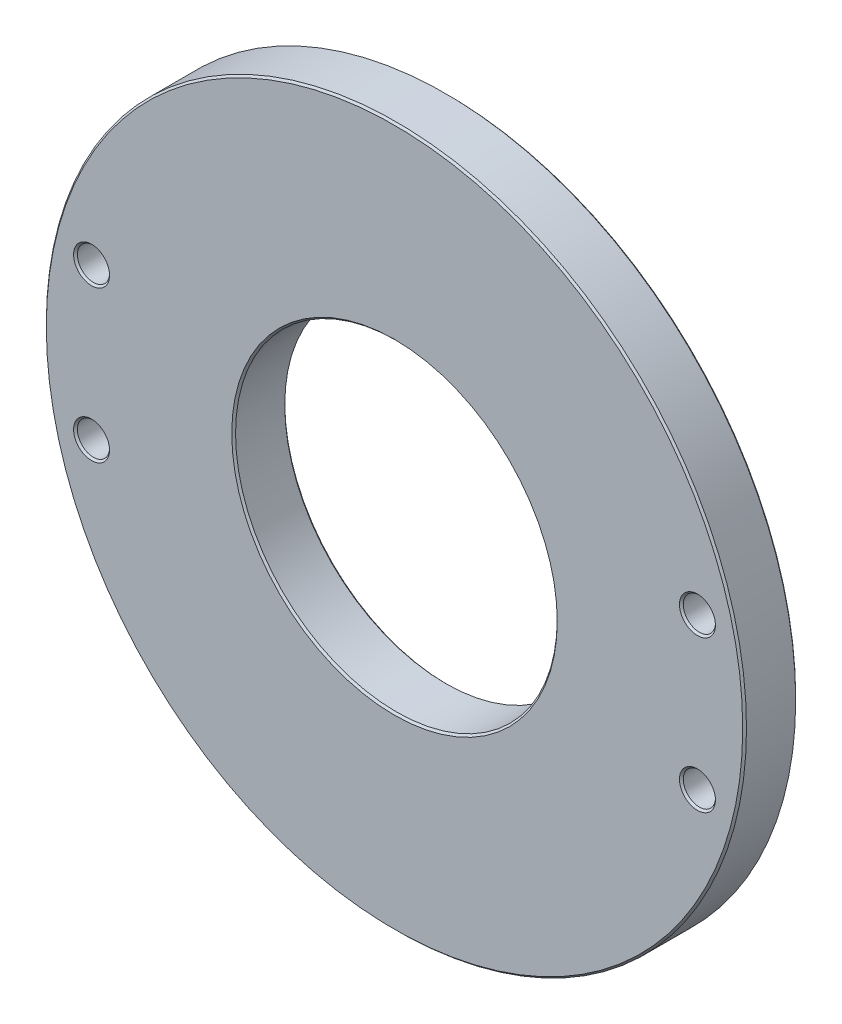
ISO-10303-21;
HEADER;
FILE_DESCRIPTION(('STEP AP214'),'2;1');
FILE_NAME('part.step','',(''),(''),'','','');
FILE_SCHEMA(('AUTOMOTIVE_DESIGN { 1 0 10303 214 1 1 1 1 }'));
ENDSEC;
DATA;
#1=APPLICATION_CONTEXT('core data for automotive mechanical design processes');
#2=APPLICATION_PROTOCOL_DEFINITION('international standard','automotive_design',2000,#1);
#3=PRODUCT_CONTEXT('',#1,'mechanical');
#4=PRODUCT('Part','Part','',(#3));
#5=PRODUCT_RELATED_PRODUCT_CATEGORY('part','',(#4));
#6=PRODUCT_DEFINITION_FORMATION('','',#4);
#7=PRODUCT_DEFINITION_CONTEXT('part definition',#1,'design');
#8=PRODUCT_DEFINITION('design','',#6,#7);
#9=PRODUCT_DEFINITION_SHAPE('','',#8);
#10=(LENGTH_UNIT() NAMED_UNIT(*) SI_UNIT(.MILLI.,.METRE.));
#11=(NAMED_UNIT(*) PLANE_ANGLE_UNIT() SI_UNIT($,.RADIAN.));
#12=(NAMED_UNIT(*) SI_UNIT($,.STERADIAN.) SOLID_ANGLE_UNIT());
#13=UNCERTAINTY_MEASURE_WITH_UNIT(LENGTH_MEASURE(1.E-05),#10,'distance_accuracy_value','');
#14=(GEOMETRIC_REPRESENTATION_CONTEXT(3) GLOBAL_UNCERTAINTY_ASSIGNED_CONTEXT((#13)) GLOBAL_UNIT_ASSIGNED_CONTEXT((#10,
#11,#12)) REPRESENTATION_CONTEXT('',''));
#15=CARTESIAN_POINT('',(0.,0.,0.));
#16=DIRECTION('',(0.,0.,1.));
#17=DIRECTION('',(1.,0.,0.));
#18=AXIS2_PLACEMENT_3D('',#15,#16,#17);
#19=CARTESIAN_POINT('',(0.,0.,-14.));
#20=DIRECTION('',(0.,0.,1.));
#21=DIRECTION('',(1.,0.,0.));
#22=AXIS2_PLACEMENT_3D('',#19,#20,#21);
#23=CYLINDRICAL_SURFACE('',#22,92.5);
#24=CARTESIAN_POINT('',(0.,0.,-13.5));
#25=DIRECTION('',(0.,0.,1.));
#26=DIRECTION('',(1.,0.,0.));
#27=AXIS2_PLACEMENT_3D('',#24,#25,#26);
#28=CIRCLE('',#27,92.5);
#29=CARTESIAN_POINT('',(92.5,0.,-13.5));
#30=VERTEX_POINT('',#29);
#31=EDGE_CURVE('E427',#30,#30,#28,.T.);
#32=ORIENTED_EDGE('',*,*,#31,.T.);
#33=EDGE_LOOP('',(#32));
#34=FACE_BOUND('',#33,.T.);
#35=CARTESIAN_POINT('',(0.,0.,-0.500000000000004));
#36=DIRECTION('',(0.,0.,1.));
#37=DIRECTION('',(1.,0.,0.));
#38=AXIS2_PLACEMENT_3D('',#35,#36,#37);
#39=CIRCLE('',#38,92.5);
#40=CARTESIAN_POINT('',(92.5,0.,-0.500000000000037));
#41=VERTEX_POINT('',#40);
#42=EDGE_CURVE('E430',#41,#41,#39,.F.);
#43=ORIENTED_EDGE('',*,*,#42,.T.);
#44=EDGE_LOOP('',(#43));
#45=FACE_BOUND('',#44,.T.);
#46=ADVANCED_FACE('F354',(#34,#45),#23,.T.);
#47=CARTESIAN_POINT('',(0.,0.,-14.));
#48=DIRECTION('',(0.,0.,1.));
#49=DIRECTION('',(1.,0.,0.));
#50=AXIS2_PLACEMENT_3D('',#47,#48,#49);
#51=PLANE('',#50);
#52=CARTESIAN_POINT('',(-80.0390529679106,20.,-14.));
#53=DIRECTION('',(0.,0.,1.));
#54=DIRECTION('',(1.,0.,0.));
#55=AXIS2_PLACEMENT_3D('',#52,#53,#54);
#56=CIRCLE('',#55,4.75000000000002);
#57=CARTESIAN_POINT('',(-75.2890529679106,20.,-14.));
#58=VERTEX_POINT('',#57);
#59=EDGE_CURVE('E373',#58,#58,#56,.T.);
#60=ORIENTED_EDGE('',*,*,#59,.T.);
#61=EDGE_LOOP('',(#60));
#62=FACE_BOUND('',#61,.T.);
#63=CARTESIAN_POINT('',(-80.0390529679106,-20.,-14.));
#64=DIRECTION('',(0.,0.,1.));
#65=DIRECTION('',(1.,0.,0.));
#66=AXIS2_PLACEMENT_3D('',#63,#64,#65);
#67=CIRCLE('',#66,4.75000000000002);
#68=CARTESIAN_POINT('',(-75.2890529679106,-20.,-14.));
#69=VERTEX_POINT('',#68);
#70=EDGE_CURVE('E376',#69,#69,#67,.T.);
#71=ORIENTED_EDGE('',*,*,#70,.T.);
#72=EDGE_LOOP('',(#71));
#73=FACE_BOUND('',#72,.T.);
#74=CARTESIAN_POINT('',(80.0390529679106,-20.,-14.));
#75=DIRECTION('',(0.,0.,1.));
#76=DIRECTION('',(1.,0.,0.));
#77=AXIS2_PLACEMENT_3D('',#74,#75,#76);
#78=CIRCLE('',#77,4.75000000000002);
#79=CARTESIAN_POINT('',(84.7890529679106,-20.,-14.));
#80=VERTEX_POINT('',#79);
#81=EDGE_CURVE('E379',#80,#80,#78,.T.);
#82=ORIENTED_EDGE('',*,*,#81,.T.);
#83=EDGE_LOOP('',(#82));
#84=FACE_BOUND('',#83,.T.);
#85=CARTESIAN_POINT('',(80.0390529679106,20.,-14.));
#86=DIRECTION('',(0.,0.,1.));
#87=DIRECTION('',(1.,0.,0.));
#88=AXIS2_PLACEMENT_3D('',#85,#86,#87);
#89=CIRCLE('',#88,4.75000000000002);
#90=CARTESIAN_POINT('',(84.7890529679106,20.,-14.));
#91=VERTEX_POINT('',#90);
#92=EDGE_CURVE('E382',#91,#91,#89,.T.);
#93=ORIENTED_EDGE('',*,*,#92,.T.);
#94=EDGE_LOOP('',(#93));
#95=FACE_BOUND('',#94,.T.);
#96=CARTESIAN_POINT('',(0.,0.,-14.));
#97=DIRECTION('',(0.,0.,1.));
#98=DIRECTION('',(1.,0.,0.));
#99=AXIS2_PLACEMENT_3D('',#96,#97,#98);
#100=CIRCLE('',#99,92.);
#101=CARTESIAN_POINT('',(92.,0.,-14.));
#102=VERTEX_POINT('',#101);
#103=EDGE_CURVE('E421',#102,#102,#100,.F.);
#104=ORIENTED_EDGE('',*,*,#103,.T.);
#105=EDGE_LOOP('',(#104));
#106=FACE_BOUND('',#105,.T.);
#107=CARTESIAN_POINT('',(0.,0.,-14.));
#108=DIRECTION('',(0.,0.,1.));
#109=DIRECTION('',(1.,0.,0.));
#110=AXIS2_PLACEMENT_3D('',#107,#108,#109);
#111=CIRCLE('',#110,43.);
#112=CARTESIAN_POINT('',(43.,0.,-14.));
#113=VERTEX_POINT('',#112);
#114=EDGE_CURVE('E424',#113,#113,#111,.T.);
#115=ORIENTED_EDGE('',*,*,#114,.T.);
#116=EDGE_LOOP('',(#115));
#117=FACE_BOUND('',#116,.T.);
#118=ADVANCED_FACE('F447',(#62,#73,#84,#95,#106,#117),#51,.F.);
#119=CARTESIAN_POINT('',(0.,0.,0.));
#120=DIRECTION('',(0.,0.,1.));
#121=DIRECTION('',(1.,0.,0.));
#122=AXIS2_PLACEMENT_3D('',#119,#120,#121);
#123=PLANE('',#122);
#124=CARTESIAN_POINT('',(-80.0390529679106,20.,0.));
#125=DIRECTION('',(0.,0.,1.));
#126=DIRECTION('',(1.,0.,0.));
#127=AXIS2_PLACEMENT_3D('',#124,#125,#126);
#128=CIRCLE('',#127,4.75);
#129=CARTESIAN_POINT('',(-75.2890529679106,20.,0.));
#130=VERTEX_POINT('',#129);
#131=EDGE_CURVE('E394',#130,#130,#128,.F.);
#132=ORIENTED_EDGE('',*,*,#131,.T.);
#133=EDGE_LOOP('',(#132));
#134=FACE_BOUND('',#133,.T.);
#135=CARTESIAN_POINT('',(-80.0390529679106,-20.,0.));
#136=DIRECTION('',(0.,0.,1.));
#137=DIRECTION('',(1.,0.,0.));
#138=AXIS2_PLACEMENT_3D('',#135,#136,#137);
#139=CIRCLE('',#138,4.75);
#140=CARTESIAN_POINT('',(-75.2890529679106,-20.,0.));
#141=VERTEX_POINT('',#140);
#142=EDGE_CURVE('E397',#141,#141,#139,.F.);
#143=ORIENTED_EDGE('',*,*,#142,.T.);
#144=EDGE_LOOP('',(#143));
#145=FACE_BOUND('',#144,.T.);
#146=CARTESIAN_POINT('',(80.0390529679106,20.,0.));
#147=DIRECTION('',(0.,0.,1.));
#148=DIRECTION('',(1.,0.,0.));
#149=AXIS2_PLACEMENT_3D('',#146,#147,#148);
#150=CIRCLE('',#149,4.75);
#151=CARTESIAN_POINT('',(84.7890529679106,20.,0.));
#152=VERTEX_POINT('',#151);
#153=EDGE_CURVE('E400',#152,#152,#150,.F.);
#154=ORIENTED_EDGE('',*,*,#153,.T.);
#155=EDGE_LOOP('',(#154));
#156=FACE_BOUND('',#155,.T.);
#157=CARTESIAN_POINT('',(80.0390529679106,-20.,0.));
#158=DIRECTION('',(0.,0.,1.));
#159=DIRECTION('',(1.,0.,0.));
#160=AXIS2_PLACEMENT_3D('',#157,#158,#159);
#161=CIRCLE('',#160,4.75);
#162=CARTESIAN_POINT('',(84.7890529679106,-20.,0.));
#163=VERTEX_POINT('',#162);
#164=EDGE_CURVE('E403',#163,#163,#161,.F.);
#165=ORIENTED_EDGE('',*,*,#164,.T.);
#166=EDGE_LOOP('',(#165));
#167=FACE_BOUND('',#166,.T.);
#168=CARTESIAN_POINT('',(0.,0.,0.));
#169=DIRECTION('',(0.,0.,1.));
#170=DIRECTION('',(1.,0.,0.));
#171=AXIS2_PLACEMENT_3D('',#168,#169,#170);
#172=CIRCLE('',#171,92.);
#173=CARTESIAN_POINT('',(92.,0.,0.));
#174=VERTEX_POINT('',#173);
#175=EDGE_CURVE('E415',#174,#174,#172,.T.);
#176=ORIENTED_EDGE('',*,*,#175,.T.);
#177=EDGE_LOOP('',(#176));
#178=FACE_BOUND('',#177,.T.);
#179=CARTESIAN_POINT('',(0.,0.,0.));
#180=DIRECTION('',(0.,0.,1.));
#181=DIRECTION('',(1.,0.,0.));
#182=AXIS2_PLACEMENT_3D('',#179,#180,#181);
#183=CIRCLE('',#182,43.);
#184=CARTESIAN_POINT('',(43.,0.,0.));
#185=VERTEX_POINT('',#184);
#186=EDGE_CURVE('E418',#185,#185,#183,.F.);
#187=ORIENTED_EDGE('',*,*,#186,.T.);
#188=EDGE_LOOP('',(#187));
#189=FACE_BOUND('',#188,.T.);
#190=ADVANCED_FACE('F443',(#134,#145,#156,#167,#178,#189),#123,.T.);
#191=CARTESIAN_POINT('',(0.,0.,-14.));
#192=DIRECTION('',(0.,0.,1.));
#193=DIRECTION('',(1.,0.,0.));
#194=AXIS2_PLACEMENT_3D('',#191,#192,#193);
#195=CYLINDRICAL_SURFACE('',#194,42.5);
#196=CARTESIAN_POINT('',(0.,0.,-13.5));
#197=DIRECTION('',(0.,0.,1.));
#198=DIRECTION('',(1.,0.,0.));
#199=AXIS2_PLACEMENT_3D('',#196,#197,#198);
#200=CIRCLE('',#199,42.5);
#201=CARTESIAN_POINT('',(42.5,0.,-13.5));
#202=VERTEX_POINT('',#201);
#203=EDGE_CURVE('E409',#202,#202,#200,.F.);
#204=ORIENTED_EDGE('',*,*,#203,.T.);
#205=EDGE_LOOP('',(#204));
#206=FACE_BOUND('',#205,.T.);
#207=CARTESIAN_POINT('',(0.,0.,-0.499999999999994));
#208=DIRECTION('',(0.,0.,1.));
#209=DIRECTION('',(1.,0.,0.));
#210=AXIS2_PLACEMENT_3D('',#207,#208,#209);
#211=CIRCLE('',#210,42.5);
#212=CARTESIAN_POINT('',(42.5,0.,-0.500000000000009));
#213=VERTEX_POINT('',#212);
#214=EDGE_CURVE('E412',#213,#213,#211,.T.);
#215=ORIENTED_EDGE('',*,*,#214,.T.);
#216=EDGE_LOOP('',(#215));
#217=FACE_BOUND('',#216,.T.);
#218=ADVANCED_FACE('F446',(#206,#217),#195,.F.);
#219=CARTESIAN_POINT('',(80.0390529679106,20.,-14.));
#220=DIRECTION('',(0.,0.,1.));
#221=DIRECTION('',(1.,0.,0.));
#222=AXIS2_PLACEMENT_3D('',#219,#220,#221);
#223=CYLINDRICAL_SURFACE('',#222,4.25);
#224=CARTESIAN_POINT('',(80.0390529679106,20.,-13.5));
#225=DIRECTION('',(0.,0.,1.));
#226=DIRECTION('',(1.,0.,0.));
#227=AXIS2_PLACEMENT_3D('',#224,#225,#226);
#228=CIRCLE('',#227,4.25);
#229=CARTESIAN_POINT('',(84.2890529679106,20.,-13.5));
#230=VERTEX_POINT('',#229);
#231=EDGE_CURVE('E12',#230,#230,#228,.F.);
#232=ORIENTED_EDGE('',*,*,#231,.T.);
#233=EDGE_LOOP('',(#232));
#234=FACE_BOUND('',#233,.T.);
#235=CARTESIAN_POINT('',(80.0390529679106,20.,-0.5));
#236=DIRECTION('',(0.,0.,1.));
#237=DIRECTION('',(1.,0.,0.));
#238=AXIS2_PLACEMENT_3D('',#235,#236,#237);
#239=CIRCLE('',#238,4.25);
#240=CARTESIAN_POINT('',(84.2890529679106,20.,-0.500000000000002));
#241=VERTEX_POINT('',#240);
#242=EDGE_CURVE('E388',#241,#241,#239,.T.);
#243=ORIENTED_EDGE('',*,*,#242,.T.);
#244=EDGE_LOOP('',(#243));
#245=FACE_BOUND('',#244,.T.);
#246=ADVANCED_FACE('F460',(#234,#245),#223,.F.);
#247=CARTESIAN_POINT('',(80.0390529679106,-20.,-14.));
#248=DIRECTION('',(0.,0.,1.));
#249=DIRECTION('',(1.,0.,0.));
#250=AXIS2_PLACEMENT_3D('',#247,#248,#249);
#251=CYLINDRICAL_SURFACE('',#250,4.25);
#252=CARTESIAN_POINT('',(80.0390529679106,-20.,-13.5));
#253=DIRECTION('',(0.,0.,1.));
#254=DIRECTION('',(1.,0.,0.));
#255=AXIS2_PLACEMENT_3D('',#252,#253,#254);
#256=CIRCLE('',#255,4.25);
#257=CARTESIAN_POINT('',(84.2890529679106,-20.,-13.5));
#258=VERTEX_POINT('',#257);
#259=EDGE_CURVE('E360',#258,#258,#256,.F.);
#260=ORIENTED_EDGE('',*,*,#259,.T.);
#261=EDGE_LOOP('',(#260));
#262=FACE_BOUND('',#261,.T.);
#263=CARTESIAN_POINT('',(80.0390529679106,-20.,-0.5));
#264=DIRECTION('',(0.,0.,1.));
#265=DIRECTION('',(1.,0.,0.));
#266=AXIS2_PLACEMENT_3D('',#263,#264,#265);
#267=CIRCLE('',#266,4.25);
#268=CARTESIAN_POINT('',(84.2890529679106,-20.,-0.500000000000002));
#269=VERTEX_POINT('',#268);
#270=EDGE_CURVE('E385',#269,#269,#267,.T.);
#271=ORIENTED_EDGE('',*,*,#270,.T.);
#272=EDGE_LOOP('',(#271));
#273=FACE_BOUND('',#272,.T.);
#274=ADVANCED_FACE('F466',(#262,#273),#251,.F.);
#275=CARTESIAN_POINT('',(-80.0390529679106,20.,-14.));
#276=DIRECTION('',(0.,0.,1.));
#277=DIRECTION('',(1.,0.,0.));
#278=AXIS2_PLACEMENT_3D('',#275,#276,#277);
#279=CYLINDRICAL_SURFACE('',#278,4.25);
#280=CARTESIAN_POINT('',(-80.0390529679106,20.,-13.5));
#281=DIRECTION('',(0.,0.,1.));
#282=DIRECTION('',(1.,0.,0.));
#283=AXIS2_PLACEMENT_3D('',#280,#281,#282);
#284=CIRCLE('',#283,4.25);
#285=CARTESIAN_POINT('',(-75.7890529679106,20.,-13.5));
#286=VERTEX_POINT('',#285);
#287=EDGE_CURVE('E368',#286,#286,#284,.F.);
#288=ORIENTED_EDGE('',*,*,#287,.T.);
#289=EDGE_LOOP('',(#288));
#290=FACE_BOUND('',#289,.T.);
#291=CARTESIAN_POINT('',(-80.0390529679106,20.,-0.499999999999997));
#292=DIRECTION('',(0.,0.,1.));
#293=DIRECTION('',(1.,0.,0.));
#294=AXIS2_PLACEMENT_3D('',#291,#292,#293);
#295=CIRCLE('',#294,4.25);
#296=CARTESIAN_POINT('',(-75.7890529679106,20.,-0.499999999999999));
#297=VERTEX_POINT('',#296);
#298=EDGE_CURVE('E406',#297,#297,#295,.T.);
#299=ORIENTED_EDGE('',*,*,#298,.T.);
#300=EDGE_LOOP('',(#299));
#301=FACE_BOUND('',#300,.T.);
#302=ADVANCED_FACE('F483',(#290,#301),#279,.F.);
#303=CARTESIAN_POINT('',(-80.0390529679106,-20.,-14.));
#304=DIRECTION('',(0.,0.,1.));
#305=DIRECTION('',(1.,0.,0.));
#306=AXIS2_PLACEMENT_3D('',#303,#304,#305);
#307=CYLINDRICAL_SURFACE('',#306,4.25);
#308=CARTESIAN_POINT('',(-80.0390529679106,-20.,-13.5));
#309=DIRECTION('',(0.,0.,1.));
#310=DIRECTION('',(1.,0.,0.));
#311=AXIS2_PLACEMENT_3D('',#308,#309,#310);
#312=CIRCLE('',#311,4.25);
#313=CARTESIAN_POINT('',(-75.7890529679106,-20.,-13.5));
#314=VERTEX_POINT('',#313);
#315=EDGE_CURVE('E364',#314,#314,#312,.F.);
#316=ORIENTED_EDGE('',*,*,#315,.T.);
#317=EDGE_LOOP('',(#316));
#318=FACE_BOUND('',#317,.T.);
#319=CARTESIAN_POINT('',(-80.0390529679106,-20.,-0.499999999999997));
#320=DIRECTION('',(0.,0.,1.));
#321=DIRECTION('',(1.,0.,0.));
#322=AXIS2_PLACEMENT_3D('',#319,#320,#321);
#323=CIRCLE('',#322,4.25);
#324=CARTESIAN_POINT('',(-75.7890529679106,-20.,-0.499999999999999));
#325=VERTEX_POINT('',#324);
#326=EDGE_CURVE('E391',#325,#325,#323,.T.);
#327=ORIENTED_EDGE('',*,*,#326,.T.);
#328=EDGE_LOOP('',(#327));
#329=FACE_BOUND('',#328,.T.);
#330=ADVANCED_FACE('F477',(#318,#329),#307,.F.);
#331=CARTESIAN_POINT('',(0.,0.,-13.5));
#332=DIRECTION('',(0.,0.,1.));
#333=DIRECTION('',(1.,0.,0.));
#334=AXIS2_PLACEMENT_3D('',#331,#332,#333);
#335=CONICAL_SURFACE('',#334,92.5,0.785398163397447);
#336=ORIENTED_EDGE('',*,*,#103,.F.);
#337=EDGE_LOOP('',(#336));
#338=FACE_BOUND('',#337,.T.);
#339=ORIENTED_EDGE('',*,*,#31,.F.);
#340=EDGE_LOOP('',(#339));
#341=FACE_BOUND('',#340,.T.);
#342=ADVANCED_FACE('F439',(#338,#341),#335,.T.);
#343=CARTESIAN_POINT('',(0.,0.,0.));
#344=DIRECTION('',(0.,0.,-1.));
#345=DIRECTION('',(-1.,0.,0.));
#346=AXIS2_PLACEMENT_3D('',#343,#344,#345);
#347=CONICAL_SURFACE('',#346,92.,0.785398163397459);
#348=ORIENTED_EDGE('',*,*,#42,.F.);
#349=EDGE_LOOP('',(#348));
#350=FACE_BOUND('',#349,.T.);
#351=ORIENTED_EDGE('',*,*,#175,.F.);
#352=EDGE_LOOP('',(#351));
#353=FACE_BOUND('',#352,.T.);
#354=ADVANCED_FACE('F435',(#350,#353),#347,.T.);
#355=CARTESIAN_POINT('',(0.,0.,-14.));
#356=DIRECTION('',(0.,0.,-1.));
#357=DIRECTION('',(-1.,0.,0.));
#358=AXIS2_PLACEMENT_3D('',#355,#356,#357);
#359=CONICAL_SURFACE('',#358,43.,0.785398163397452);
#360=ORIENTED_EDGE('',*,*,#203,.F.);
#361=EDGE_LOOP('',(#360));
#362=FACE_BOUND('',#361,.T.);
#363=ORIENTED_EDGE('',*,*,#114,.F.);
#364=EDGE_LOOP('',(#363));
#365=FACE_BOUND('',#364,.T.);
#366=ADVANCED_FACE('F438',(#362,#365),#359,.F.);
#367=CARTESIAN_POINT('',(0.,0.,-0.499999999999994));
#368=DIRECTION('',(0.,0.,1.));
#369=DIRECTION('',(1.,0.,0.));
#370=AXIS2_PLACEMENT_3D('',#367,#368,#369);
#371=CONICAL_SURFACE('',#370,42.5,0.785398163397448);
#372=ORIENTED_EDGE('',*,*,#186,.F.);
#373=EDGE_LOOP('',(#372));
#374=FACE_BOUND('',#373,.T.);
#375=ORIENTED_EDGE('',*,*,#214,.F.);
#376=EDGE_LOOP('',(#375));
#377=FACE_BOUND('',#376,.T.);
#378=ADVANCED_FACE('F452',(#374,#377),#371,.F.);
#379=CARTESIAN_POINT('',(-80.0390529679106,20.,-0.499999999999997));
#380=DIRECTION('',(0.,0.,1.));
#381=DIRECTION('',(1.,0.,0.));
#382=AXIS2_PLACEMENT_3D('',#379,#380,#381);
#383=CONICAL_SURFACE('',#382,4.25,0.785398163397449);
#384=ORIENTED_EDGE('',*,*,#131,.F.);
#385=EDGE_LOOP('',(#384));
#386=FACE_BOUND('',#385,.T.);
#387=ORIENTED_EDGE('',*,*,#298,.F.);
#388=EDGE_LOOP('',(#387));
#389=FACE_BOUND('',#388,.T.);
#390=ADVANCED_FACE('F455',(#386,#389),#383,.F.);
#391=CARTESIAN_POINT('',(-80.0390529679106,-20.,-0.499999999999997));
#392=DIRECTION('',(0.,0.,1.));
#393=DIRECTION('',(1.,0.,0.));
#394=AXIS2_PLACEMENT_3D('',#391,#392,#393);
#395=CONICAL_SURFACE('',#394,4.25,0.785398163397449);
#396=ORIENTED_EDGE('',*,*,#142,.F.);
#397=EDGE_LOOP('',(#396));
#398=FACE_BOUND('',#397,.T.);
#399=ORIENTED_EDGE('',*,*,#326,.F.);
#400=EDGE_LOOP('',(#399));
#401=FACE_BOUND('',#400,.T.);
#402=ADVANCED_FACE('F511',(#398,#401),#395,.F.);
#403=CARTESIAN_POINT('',(80.0390529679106,20.,-0.5));
#404=DIRECTION('',(0.,0.,1.));
#405=DIRECTION('',(1.,0.,0.));
#406=AXIS2_PLACEMENT_3D('',#403,#404,#405);
#407=CONICAL_SURFACE('',#406,4.25,0.785398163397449);
#408=ORIENTED_EDGE('',*,*,#153,.F.);
#409=EDGE_LOOP('',(#408));
#410=FACE_BOUND('',#409,.T.);
#411=ORIENTED_EDGE('',*,*,#242,.F.);
#412=EDGE_LOOP('',(#411));
#413=FACE_BOUND('',#412,.T.);
#414=ADVANCED_FACE('F501',(#410,#413),#407,.F.);
#415=CARTESIAN_POINT('',(80.0390529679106,-20.,-0.5));
#416=DIRECTION('',(0.,0.,1.));
#417=DIRECTION('',(1.,0.,0.));
#418=AXIS2_PLACEMENT_3D('',#415,#416,#417);
#419=CONICAL_SURFACE('',#418,4.25,0.785398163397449);
#420=ORIENTED_EDGE('',*,*,#164,.F.);
#421=EDGE_LOOP('',(#420));
#422=FACE_BOUND('',#421,.T.);
#423=ORIENTED_EDGE('',*,*,#270,.F.);
#424=EDGE_LOOP('',(#423));
#425=FACE_BOUND('',#424,.T.);
#426=ADVANCED_FACE('F498',(#422,#425),#419,.F.);
#427=CARTESIAN_POINT('',(-80.0390529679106,20.,-14.));
#428=DIRECTION('',(0.,0.,-1.));
#429=DIRECTION('',(-1.,0.,0.));
#430=AXIS2_PLACEMENT_3D('',#427,#428,#429);
#431=CONICAL_SURFACE('',#430,4.75000000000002,0.785398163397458);
#432=ORIENTED_EDGE('',*,*,#287,.F.);
#433=EDGE_LOOP('',(#432));
#434=FACE_BOUND('',#433,.T.);
#435=ORIENTED_EDGE('',*,*,#59,.F.);
#436=EDGE_LOOP('',(#435));
#437=FACE_BOUND('',#436,.T.);
#438=ADVANCED_FACE('F500',(#434,#437),#431,.F.);
#439=CARTESIAN_POINT('',(-80.0390529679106,-20.,-14.));
#440=DIRECTION('',(0.,0.,-1.));
#441=DIRECTION('',(-1.,0.,0.));
#442=AXIS2_PLACEMENT_3D('',#439,#440,#441);
#443=CONICAL_SURFACE('',#442,4.75000000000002,0.785398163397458);
#444=ORIENTED_EDGE('',*,*,#315,.F.);
#445=EDGE_LOOP('',(#444));
#446=FACE_BOUND('',#445,.T.);
#447=ORIENTED_EDGE('',*,*,#70,.F.);
#448=EDGE_LOOP('',(#447));
#449=FACE_BOUND('',#448,.T.);
#450=ADVANCED_FACE('F508',(#446,#449),#443,.F.);
#451=CARTESIAN_POINT('',(80.0390529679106,-20.,-14.));
#452=DIRECTION('',(0.,0.,-1.));
#453=DIRECTION('',(-1.,0.,0.));
#454=AXIS2_PLACEMENT_3D('',#451,#452,#453);
#455=CONICAL_SURFACE('',#454,4.75000000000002,0.785398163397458);
#456=ORIENTED_EDGE('',*,*,#259,.F.);
#457=EDGE_LOOP('',(#456));
#458=FACE_BOUND('',#457,.T.);
#459=ORIENTED_EDGE('',*,*,#81,.F.);
#460=EDGE_LOOP('',(#459));
#461=FACE_BOUND('',#460,.T.);
#462=ADVANCED_FACE('F557',(#458,#461),#455,.F.);
#463=CARTESIAN_POINT('',(80.0390529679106,20.,-14.));
#464=DIRECTION('',(0.,0.,-1.));
#465=DIRECTION('',(-1.,0.,0.));
#466=AXIS2_PLACEMENT_3D('',#463,#464,#465);
#467=CONICAL_SURFACE('',#466,4.75000000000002,0.785398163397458);
#468=ORIENTED_EDGE('',*,*,#231,.F.);
#469=EDGE_LOOP('',(#468));
#470=FACE_BOUND('',#469,.T.);
#471=ORIENTED_EDGE('',*,*,#92,.F.);
#472=EDGE_LOOP('',(#471));
#473=FACE_BOUND('',#472,.T.);
#474=ADVANCED_FACE('F561',(#470,#473),#467,.F.);
#475=CLOSED_SHELL('',(#46,#118,#190,#218,#246,#274,#302,#330,#342,#354,#366,#378,#390,#402,#414,
#426,#438,#450,#462,#474));
#476=MANIFOLD_SOLID_BREP('B2',#475);
#477=ADVANCED_BREP_SHAPE_REPRESENTATION('',(#18,#476),#14);
#478=SHAPE_DEFINITION_REPRESENTATION(#9,#477);
ENDSEC;
END-ISO-10303-21;
